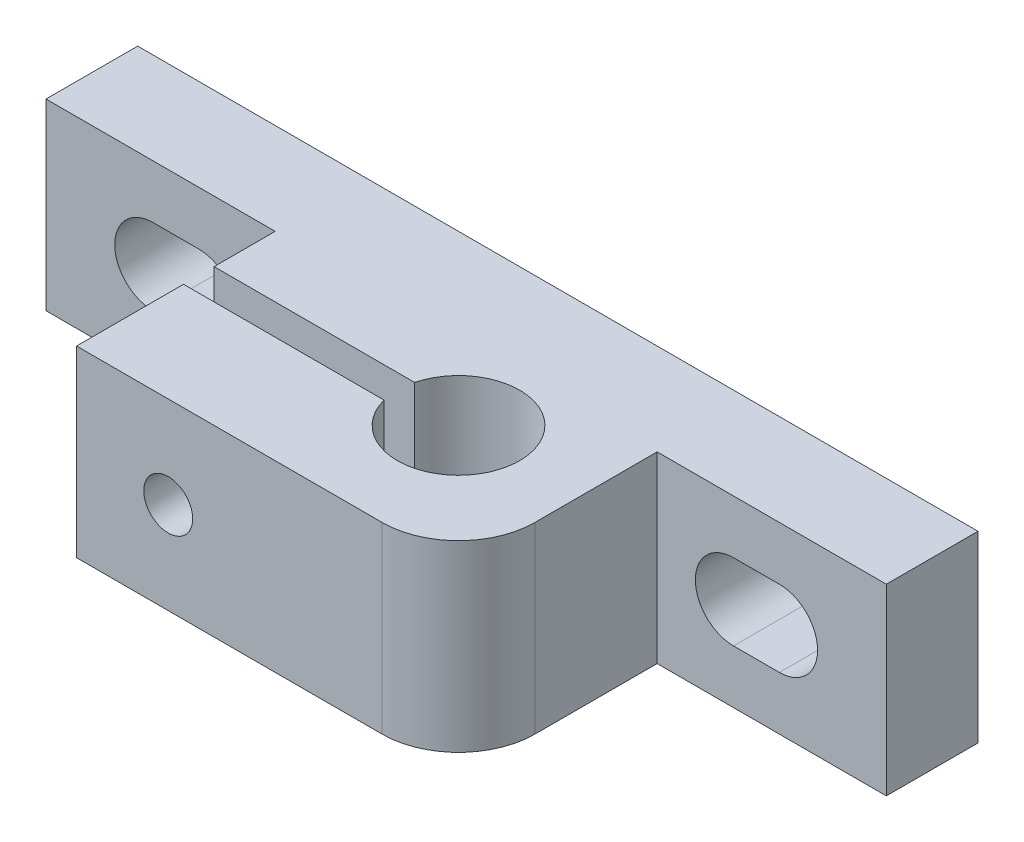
ISO-10303-21;
HEADER;
FILE_DESCRIPTION(('STEP AP214'),'2;1');
FILE_NAME('part.step','',(''),(''),'','','');
FILE_SCHEMA(('AUTOMOTIVE_DESIGN { 1 0 10303 214 1 1 1 1 }'));
ENDSEC;
DATA;
#1=APPLICATION_CONTEXT('core data for automotive mechanical design processes');
#2=APPLICATION_PROTOCOL_DEFINITION('international standard','automotive_design',2000,#1);
#3=PRODUCT_CONTEXT('',#1,'mechanical');
#4=PRODUCT('Part','Part','',(#3));
#5=PRODUCT_RELATED_PRODUCT_CATEGORY('part','',(#4));
#6=PRODUCT_DEFINITION_FORMATION('','',#4);
#7=PRODUCT_DEFINITION_CONTEXT('part definition',#1,'design');
#8=PRODUCT_DEFINITION('design','',#6,#7);
#9=PRODUCT_DEFINITION_SHAPE('','',#8);
#10=(LENGTH_UNIT() NAMED_UNIT(*) SI_UNIT(.MILLI.,.METRE.));
#11=(NAMED_UNIT(*) PLANE_ANGLE_UNIT() SI_UNIT($,.RADIAN.));
#12=(NAMED_UNIT(*) SI_UNIT($,.STERADIAN.) SOLID_ANGLE_UNIT());
#13=UNCERTAINTY_MEASURE_WITH_UNIT(LENGTH_MEASURE(1.E-05),#10,'distance_accuracy_value','');
#14=(GEOMETRIC_REPRESENTATION_CONTEXT(3) GLOBAL_UNCERTAINTY_ASSIGNED_CONTEXT((#13)) GLOBAL_UNIT_ASSIGNED_CONTEXT((#10,
#11,#12)) REPRESENTATION_CONTEXT('',''));
#15=CARTESIAN_POINT('',(0.,0.,0.));
#16=DIRECTION('',(0.,0.,1.));
#17=DIRECTION('',(1.,0.,0.));
#18=AXIS2_PLACEMENT_3D('',#15,#16,#17);
#19=CARTESIAN_POINT('',(21.,6.,-1.));
#20=DIRECTION('',(0.,0.,1.));
#21=DIRECTION('',(1.,0.,0.));
#22=AXIS2_PLACEMENT_3D('',#19,#20,#21);
#23=CYLINDRICAL_SURFACE('',#22,1.6);
#24=CARTESIAN_POINT('',(21.,6.,10.));
#25=DIRECTION('',(0.,0.,-1.));
#26=DIRECTION('',(-1.,0.,0.));
#27=AXIS2_PLACEMENT_3D('',#24,#25,#26);
#28=CIRCLE('',#27,1.6);
#29=CARTESIAN_POINT('',(19.4,6.,10.));
#30=VERTEX_POINT('',#29);
#31=EDGE_CURVE('E298',#30,#30,#28,.T.);
#32=ORIENTED_EDGE('',*,*,#31,.F.);
#33=EDGE_LOOP('',(#32));
#34=FACE_BOUND('',#33,.T.);
#35=CARTESIAN_POINT('',(21.,6.,8.));
#36=DIRECTION('',(0.,0.,-1.));
#37=DIRECTION('',(-1.,0.,0.));
#38=AXIS2_PLACEMENT_3D('',#35,#36,#37);
#39=CIRCLE('',#38,1.6);
#40=CARTESIAN_POINT('',(19.4,6.,8.));
#41=VERTEX_POINT('',#40);
#42=EDGE_CURVE('E37',#41,#41,#39,.F.);
#43=ORIENTED_EDGE('',*,*,#42,.F.);
#44=EDGE_LOOP('',(#43));
#45=FACE_BOUND('',#44,.T.);
#46=ADVANCED_FACE('F33',(#34,#45),#23,.F.);
#47=CARTESIAN_POINT('',(15.,0.,19.));
#48=DIRECTION('',(1.,0.,0.));
#49=DIRECTION('',(0.,0.,-1.));
#50=AXIS2_PLACEMENT_3D('',#47,#48,#49);
#51=PLANE('',#50);
#52=DIRECTION('',(0.,0.,-1.));
#53=VECTOR('',#52,1.);
#54=CARTESIAN_POINT('',(15.,0.,19.));
#55=LINE('',#54,#53);
#56=CARTESIAN_POINT('',(15.,0.,10.));
#57=VERTEX_POINT('',#56);
#58=CARTESIAN_POINT('',(15.,0.,6.));
#59=VERTEX_POINT('',#58);
#60=EDGE_CURVE('E382',#57,#59,#55,.T.);
#61=ORIENTED_EDGE('',*,*,#60,.F.);
#62=DIRECTION('',(0.,1.,0.));
#63=VECTOR('',#62,1.);
#64=CARTESIAN_POINT('',(15.,0.,10.));
#65=LINE('',#64,#63);
#66=CARTESIAN_POINT('',(15.,12.,10.));
#67=VERTEX_POINT('',#66);
#68=EDGE_CURVE('E42',#57,#67,#65,.T.);
#69=ORIENTED_EDGE('',*,*,#68,.T.);
#70=DIRECTION('',(0.,0.,-1.));
#71=VECTOR('',#70,1.);
#72=CARTESIAN_POINT('',(15.,12.,19.));
#73=LINE('',#72,#71);
#74=CARTESIAN_POINT('',(15.,12.,6.));
#75=VERTEX_POINT('',#74);
#76=EDGE_CURVE('E359',#67,#75,#73,.T.);
#77=ORIENTED_EDGE('',*,*,#76,.T.);
#78=DIRECTION('',(0.,-1.,0.));
#79=VECTOR('',#78,1.);
#80=CARTESIAN_POINT('',(15.,0.,6.));
#81=LINE('',#80,#79);
#82=EDGE_CURVE('E349',#75,#59,#81,.T.);
#83=ORIENTED_EDGE('',*,*,#82,.T.);
#84=EDGE_LOOP('',(#61,#69,#77,#83));
#85=FACE_BOUND('',#84,.T.);
#86=ADVANCED_FACE('F392',(#85),#51,.F.);
#87=CARTESIAN_POINT('',(0.,0.,6.));
#88=DIRECTION('',(0.,0.,-1.));
#89=DIRECTION('',(-1.,0.,0.));
#90=AXIS2_PLACEMENT_3D('',#87,#88,#89);
#91=PLANE('',#90);
#92=CARTESIAN_POINT('',(7.,6.,6.));
#93=DIRECTION('',(0.,0.,1.));
#94=DIRECTION('',(1.,0.,0.));
#95=AXIS2_PLACEMENT_3D('',#92,#93,#94);
#96=CIRCLE('',#95,2.5);
#97=CARTESIAN_POINT('',(7.,8.5,6.));
#98=VERTEX_POINT('',#97);
#99=CARTESIAN_POINT('',(7.,3.5,6.));
#100=VERTEX_POINT('',#99);
#101=EDGE_CURVE('E461',#98,#100,#96,.T.);
#102=ORIENTED_EDGE('',*,*,#101,.F.);
#103=DIRECTION('',(-1.,0.,0.));
#104=VECTOR('',#103,1.);
#105=CARTESIAN_POINT('',(7.,8.5,6.));
#106=LINE('',#105,#104);
#107=CARTESIAN_POINT('',(10.,8.5,6.));
#108=VERTEX_POINT('',#107);
#109=EDGE_CURVE('E457',#108,#98,#106,.T.);
#110=ORIENTED_EDGE('',*,*,#109,.F.);
#111=CARTESIAN_POINT('',(10.,6.,6.));
#112=DIRECTION('',(0.,0.,1.));
#113=DIRECTION('',(1.,0.,0.));
#114=AXIS2_PLACEMENT_3D('',#111,#112,#113);
#115=CIRCLE('',#114,2.5);
#116=CARTESIAN_POINT('',(9.99999999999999,3.5,6.));
#117=VERTEX_POINT('',#116);
#118=EDGE_CURVE('E473',#117,#108,#115,.T.);
#119=ORIENTED_EDGE('',*,*,#118,.F.);
#120=DIRECTION('',(1.,0.,0.));
#121=VECTOR('',#120,1.);
#122=CARTESIAN_POINT('',(7.,3.5,6.));
#123=LINE('',#122,#121);
#124=EDGE_CURVE('E476',#100,#117,#123,.T.);
#125=ORIENTED_EDGE('',*,*,#124,.F.);
#126=EDGE_LOOP('',(#102,#110,#119,#125));
#127=FACE_BOUND('',#126,.T.);
#128=ORIENTED_EDGE('',*,*,#82,.F.);
#129=DIRECTION('',(-1.,0.,0.));
#130=VECTOR('',#129,1.);
#131=CARTESIAN_POINT('',(0.,12.,6.));
#132=LINE('',#131,#130);
#133=CARTESIAN_POINT('',(0.,12.,6.));
#134=VERTEX_POINT('',#133);
#135=EDGE_CURVE('E400',#75,#134,#132,.T.);
#136=ORIENTED_EDGE('',*,*,#135,.T.);
#137=DIRECTION('',(0.,-1.,0.));
#138=VECTOR('',#137,1.);
#139=CARTESIAN_POINT('',(0.,0.,6.));
#140=LINE('',#139,#138);
#141=CARTESIAN_POINT('',(0.,0.,6.));
#142=VERTEX_POINT('',#141);
#143=EDGE_CURVE('E431',#134,#142,#140,.T.);
#144=ORIENTED_EDGE('',*,*,#143,.T.);
#145=DIRECTION('',(1.,0.,0.));
#146=VECTOR('',#145,1.);
#147=CARTESIAN_POINT('',(0.,0.,6.));
#148=LINE('',#147,#146);
#149=EDGE_CURVE('E411',#142,#59,#148,.T.);
#150=ORIENTED_EDGE('',*,*,#149,.T.);
#151=EDGE_LOOP('',(#128,#136,#144,#150));
#152=FACE_BOUND('',#151,.T.);
#153=ADVANCED_FACE('F548',(#127,#152),#91,.F.);
#154=CARTESIAN_POINT('',(48.,6.,6.));
#155=DIRECTION('',(0.,0.,1.));
#156=DIRECTION('',(-1.,0.,0.));
#157=AXIS2_PLACEMENT_3D('',#154,#155,#156);
#158=CIRCLE('',#157,2.5);
#159=CARTESIAN_POINT('',(48.,3.5,6.));
#160=VERTEX_POINT('',#159);
#161=CARTESIAN_POINT('',(48.,8.5,6.));
#162=VERTEX_POINT('',#161);
#163=EDGE_CURVE('E492',#160,#162,#158,.T.);
#164=ORIENTED_EDGE('',*,*,#163,.F.);
#165=DIRECTION('',(1.,0.,0.));
#166=VECTOR('',#165,1.);
#167=CARTESIAN_POINT('',(48.,3.5,6.));
#168=LINE('',#167,#166);
#169=CARTESIAN_POINT('',(45.,3.5,6.));
#170=VERTEX_POINT('',#169);
#171=EDGE_CURVE('E488',#170,#160,#168,.T.);
#172=ORIENTED_EDGE('',*,*,#171,.F.);
#173=CARTESIAN_POINT('',(45.,6.,6.));
#174=DIRECTION('',(0.,0.,1.));
#175=DIRECTION('',(-1.,0.,0.));
#176=AXIS2_PLACEMENT_3D('',#173,#174,#175);
#177=CIRCLE('',#176,2.5);
#178=CARTESIAN_POINT('',(45.,8.5,6.));
#179=VERTEX_POINT('',#178);
#180=EDGE_CURVE('E504',#179,#170,#177,.T.);
#181=ORIENTED_EDGE('',*,*,#180,.F.);
#182=DIRECTION('',(-1.,0.,0.));
#183=VECTOR('',#182,1.);
#184=CARTESIAN_POINT('',(48.,8.5,6.));
#185=LINE('',#184,#183);
#186=EDGE_CURVE('E507',#162,#179,#185,.T.);
#187=ORIENTED_EDGE('',*,*,#186,.F.);
#188=EDGE_LOOP('',(#164,#172,#181,#187));
#189=FACE_BOUND('',#188,.T.);
#190=DIRECTION('',(0.,1.,0.));
#191=VECTOR('',#190,1.);
#192=CARTESIAN_POINT('',(40.,0.,6.));
#193=LINE('',#192,#191);
#194=CARTESIAN_POINT('',(40.,0.,6.));
#195=VERTEX_POINT('',#194);
#196=CARTESIAN_POINT('',(40.,12.,6.));
#197=VERTEX_POINT('',#196);
#198=EDGE_CURVE('E354',#195,#197,#193,.T.);
#199=ORIENTED_EDGE('',*,*,#198,.F.);
#200=CARTESIAN_POINT('',(55.,0.,6.));
#201=VERTEX_POINT('',#200);
#202=EDGE_CURVE('E443',#195,#201,#148,.T.);
#203=ORIENTED_EDGE('',*,*,#202,.T.);
#204=DIRECTION('',(0.,1.,0.));
#205=VECTOR('',#204,1.);
#206=CARTESIAN_POINT('',(55.,0.,6.));
#207=LINE('',#206,#205);
#208=CARTESIAN_POINT('',(55.,12.,6.));
#209=VERTEX_POINT('',#208);
#210=EDGE_CURVE('E407',#201,#209,#207,.T.);
#211=ORIENTED_EDGE('',*,*,#210,.T.);
#212=EDGE_CURVE('E406',#209,#197,#132,.T.);
#213=ORIENTED_EDGE('',*,*,#212,.T.);
#214=EDGE_LOOP('',(#199,#203,#211,#213));
#215=FACE_BOUND('',#214,.T.);
#216=ADVANCED_FACE('F520',(#189,#215),#91,.F.);
#217=CARTESIAN_POINT('',(0.,0.,0.));
#218=DIRECTION('',(0.,0.,-1.));
#219=DIRECTION('',(-1.,0.,0.));
#220=AXIS2_PLACEMENT_3D('',#217,#218,#219);
#221=PLANE('',#220);
#222=DIRECTION('',(0.,-1.,0.));
#223=VECTOR('',#222,1.);
#224=CARTESIAN_POINT('',(37.6724189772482,9.5,0.));
#225=LINE('',#224,#223);
#226=CARTESIAN_POINT('',(37.6724189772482,9.5,0.));
#227=VERTEX_POINT('',#226);
#228=CARTESIAN_POINT('',(37.6724189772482,2.5,0.));
#229=VERTEX_POINT('',#228);
#230=EDGE_CURVE('E57',#227,#229,#225,.T.);
#231=ORIENTED_EDGE('',*,*,#230,.F.);
#232=DIRECTION('',(1.,0.,0.));
#233=VECTOR('',#232,1.);
#234=CARTESIAN_POINT('',(37.6724189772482,9.5,0.));
#235=LINE('',#234,#233);
#236=CARTESIAN_POINT('',(17.15852847,9.5,0.));
#237=VERTEX_POINT('',#236);
#238=EDGE_CURVE('E305',#237,#227,#235,.T.);
#239=ORIENTED_EDGE('',*,*,#238,.F.);
#240=DIRECTION('',(0.,1.,0.));
#241=VECTOR('',#240,1.);
#242=CARTESIAN_POINT('',(17.15852847,9.5,0.));
#243=LINE('',#242,#241);
#244=CARTESIAN_POINT('',(17.15852847,2.5,0.));
#245=VERTEX_POINT('',#244);
#246=EDGE_CURVE('E319',#245,#237,#243,.T.);
#247=ORIENTED_EDGE('',*,*,#246,.F.);
#248=DIRECTION('',(-1.,0.,0.));
#249=VECTOR('',#248,1.);
#250=CARTESIAN_POINT('',(37.6724189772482,2.5,0.));
#251=LINE('',#250,#249);
#252=EDGE_CURVE('E316',#229,#245,#251,.T.);
#253=ORIENTED_EDGE('',*,*,#252,.F.);
#254=EDGE_LOOP('',(#231,#239,#247,#253));
#255=FACE_BOUND('',#254,.T.);
#256=DIRECTION('',(-1.,0.,0.));
#257=VECTOR('',#256,1.);
#258=CARTESIAN_POINT('',(7.,8.5,0.));
#259=LINE('',#258,#257);
#260=CARTESIAN_POINT('',(10.,8.5,0.));
#261=VERTEX_POINT('',#260);
#262=CARTESIAN_POINT('',(7.,8.5,0.));
#263=VERTEX_POINT('',#262);
#264=EDGE_CURVE('E458',#261,#263,#259,.T.);
#265=ORIENTED_EDGE('',*,*,#264,.T.);
#266=CARTESIAN_POINT('',(7.,6.,0.));
#267=DIRECTION('',(0.,0.,1.));
#268=DIRECTION('',(1.,0.,0.));
#269=AXIS2_PLACEMENT_3D('',#266,#267,#268);
#270=CIRCLE('',#269,2.5);
#271=CARTESIAN_POINT('',(7.,3.5,0.));
#272=VERTEX_POINT('',#271);
#273=EDGE_CURVE('E468',#263,#272,#270,.T.);
#274=ORIENTED_EDGE('',*,*,#273,.T.);
#275=DIRECTION('',(1.,0.,0.));
#276=VECTOR('',#275,1.);
#277=CARTESIAN_POINT('',(7.,3.5,0.));
#278=LINE('',#277,#276);
#279=CARTESIAN_POINT('',(9.99999999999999,3.5,0.));
#280=VERTEX_POINT('',#279);
#281=EDGE_CURVE('E465',#272,#280,#278,.T.);
#282=ORIENTED_EDGE('',*,*,#281,.T.);
#283=CARTESIAN_POINT('',(10.,6.,0.));
#284=DIRECTION('',(0.,0.,1.));
#285=DIRECTION('',(1.,0.,0.));
#286=AXIS2_PLACEMENT_3D('',#283,#284,#285);
#287=CIRCLE('',#286,2.5);
#288=EDGE_CURVE('E462',#280,#261,#287,.T.);
#289=ORIENTED_EDGE('',*,*,#288,.T.);
#290=EDGE_LOOP('',(#265,#274,#282,#289));
#291=FACE_BOUND('',#290,.T.);
#292=DIRECTION('',(0.,-1.,0.));
#293=VECTOR('',#292,1.);
#294=CARTESIAN_POINT('',(0.,0.,0.));
#295=LINE('',#294,#293);
#296=CARTESIAN_POINT('',(0.,12.,0.));
#297=VERTEX_POINT('',#296);
#298=CARTESIAN_POINT('',(0.,0.,0.));
#299=VERTEX_POINT('',#298);
#300=EDGE_CURVE('E420',#297,#299,#295,.T.);
#301=ORIENTED_EDGE('',*,*,#300,.F.);
#302=DIRECTION('',(-1.,0.,0.));
#303=VECTOR('',#302,1.);
#304=CARTESIAN_POINT('',(0.,12.,0.));
#305=LINE('',#304,#303);
#306=CARTESIAN_POINT('',(55.,12.,0.));
#307=VERTEX_POINT('',#306);
#308=EDGE_CURVE('E429',#307,#297,#305,.T.);
#309=ORIENTED_EDGE('',*,*,#308,.F.);
#310=DIRECTION('',(0.,1.,0.));
#311=VECTOR('',#310,1.);
#312=CARTESIAN_POINT('',(55.,0.,0.));
#313=LINE('',#312,#311);
#314=CARTESIAN_POINT('',(55.,0.,0.));
#315=VERTEX_POINT('',#314);
#316=EDGE_CURVE('E427',#315,#307,#313,.T.);
#317=ORIENTED_EDGE('',*,*,#316,.F.);
#318=DIRECTION('',(1.,0.,0.));
#319=VECTOR('',#318,1.);
#320=CARTESIAN_POINT('',(0.,0.,0.));
#321=LINE('',#320,#319);
#322=EDGE_CURVE('E424',#299,#315,#321,.T.);
#323=ORIENTED_EDGE('',*,*,#322,.F.);
#324=EDGE_LOOP('',(#301,#309,#317,#323));
#325=FACE_BOUND('',#324,.T.);
#326=DIRECTION('',(1.,0.,0.));
#327=VECTOR('',#326,1.);
#328=CARTESIAN_POINT('',(48.,3.5,0.));
#329=LINE('',#328,#327);
#330=CARTESIAN_POINT('',(45.,3.5,0.));
#331=VERTEX_POINT('',#330);
#332=CARTESIAN_POINT('',(48.,3.5,0.));
#333=VERTEX_POINT('',#332);
#334=EDGE_CURVE('E489',#331,#333,#329,.T.);
#335=ORIENTED_EDGE('',*,*,#334,.T.);
#336=CARTESIAN_POINT('',(48.,6.,0.));
#337=DIRECTION('',(0.,0.,1.));
#338=DIRECTION('',(-1.,0.,0.));
#339=AXIS2_PLACEMENT_3D('',#336,#337,#338);
#340=CIRCLE('',#339,2.5);
#341=CARTESIAN_POINT('',(48.,8.5,0.));
#342=VERTEX_POINT('',#341);
#343=EDGE_CURVE('E499',#333,#342,#340,.T.);
#344=ORIENTED_EDGE('',*,*,#343,.T.);
#345=DIRECTION('',(-1.,0.,0.));
#346=VECTOR('',#345,1.);
#347=CARTESIAN_POINT('',(48.,8.5,0.));
#348=LINE('',#347,#346);
#349=CARTESIAN_POINT('',(45.,8.5,0.));
#350=VERTEX_POINT('',#349);
#351=EDGE_CURVE('E496',#342,#350,#348,.T.);
#352=ORIENTED_EDGE('',*,*,#351,.T.);
#353=CARTESIAN_POINT('',(45.,6.,0.));
#354=DIRECTION('',(0.,0.,1.));
#355=DIRECTION('',(-1.,0.,0.));
#356=AXIS2_PLACEMENT_3D('',#353,#354,#355);
#357=CIRCLE('',#356,2.5);
#358=EDGE_CURVE('E493',#350,#331,#357,.T.);
#359=ORIENTED_EDGE('',*,*,#358,.T.);
#360=EDGE_LOOP('',(#335,#344,#352,#359));
#361=FACE_BOUND('',#360,.T.);
#362=ADVANCED_FACE('F527',(#255,#291,#325,#361),#221,.T.);
#363=CARTESIAN_POINT('',(0.,0.,6.));
#364=DIRECTION('',(1.,0.,0.));
#365=DIRECTION('',(0.,0.,-1.));
#366=AXIS2_PLACEMENT_3D('',#363,#364,#365);
#367=PLANE('',#366);
#368=ORIENTED_EDGE('',*,*,#300,.T.);
#369=DIRECTION('',(0.,0.,-1.));
#370=VECTOR('',#369,1.);
#371=CARTESIAN_POINT('',(0.,0.,6.));
#372=LINE('',#371,#370);
#373=EDGE_CURVE('E439',#142,#299,#372,.T.);
#374=ORIENTED_EDGE('',*,*,#373,.F.);
#375=ORIENTED_EDGE('',*,*,#143,.F.);
#376=DIRECTION('',(0.,0.,-1.));
#377=VECTOR('',#376,1.);
#378=CARTESIAN_POINT('',(0.,12.,6.));
#379=LINE('',#378,#377);
#380=EDGE_CURVE('E402',#134,#297,#379,.T.);
#381=ORIENTED_EDGE('',*,*,#380,.T.);
#382=EDGE_LOOP('',(#368,#374,#375,#381));
#383=FACE_BOUND('',#382,.T.);
#384=ADVANCED_FACE('F620',(#383),#367,.F.);
#385=CARTESIAN_POINT('',(0.,0.,6.));
#386=DIRECTION('',(0.,1.,0.));
#387=DIRECTION('',(0.,0.,1.));
#388=AXIS2_PLACEMENT_3D('',#385,#386,#387);
#389=PLANE('',#388);
#390=CARTESIAN_POINT('',(32.,0.,11.));
#391=DIRECTION('',(0.,-1.,0.));
#392=DIRECTION('',(0.,0.,-1.));
#393=AXIS2_PLACEMENT_3D('',#390,#391,#392);
#394=CIRCLE('',#393,4.);
#395=CARTESIAN_POINT('',(28.1270166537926,0.,10.));
#396=VERTEX_POINT('',#395);
#397=CARTESIAN_POINT('',(28.1270166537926,0.,12.));
#398=VERTEX_POINT('',#397);
#399=EDGE_CURVE('E334',#396,#398,#394,.T.);
#400=ORIENTED_EDGE('',*,*,#399,.F.);
#401=DIRECTION('',(1.,0.,0.));
#402=VECTOR('',#401,1.);
#403=CARTESIAN_POINT('',(0.,0.,10.));
#404=LINE('',#403,#402);
#405=EDGE_CURVE('E326',#57,#396,#404,.T.);
#406=ORIENTED_EDGE('',*,*,#405,.F.);
#407=ORIENTED_EDGE('',*,*,#60,.T.);
#408=ORIENTED_EDGE('',*,*,#149,.F.);
#409=ORIENTED_EDGE('',*,*,#373,.T.);
#410=ORIENTED_EDGE('',*,*,#322,.T.);
#411=DIRECTION('',(0.,0.,-1.));
#412=VECTOR('',#411,1.);
#413=CARTESIAN_POINT('',(55.,0.,6.));
#414=LINE('',#413,#412);
#415=EDGE_CURVE('E436',#201,#315,#414,.T.);
#416=ORIENTED_EDGE('',*,*,#415,.F.);
#417=ORIENTED_EDGE('',*,*,#202,.F.);
#418=DIRECTION('',(0.,0.,-1.));
#419=VECTOR('',#418,1.);
#420=CARTESIAN_POINT('',(40.,0.,19.));
#421=LINE('',#420,#419);
#422=CARTESIAN_POINT('',(40.,0.,14.));
#423=VERTEX_POINT('',#422);
#424=EDGE_CURVE('E584',#423,#195,#421,.T.);
#425=ORIENTED_EDGE('',*,*,#424,.F.);
#426=CARTESIAN_POINT('',(35.,0.,14.));
#427=DIRECTION('',(0.,1.,0.));
#428=DIRECTION('',(0.,0.,1.));
#429=AXIS2_PLACEMENT_3D('',#426,#427,#428);
#430=CIRCLE('',#429,5.);
#431=CARTESIAN_POINT('',(35.,0.,19.));
#432=VERTEX_POINT('',#431);
#433=EDGE_CURVE('E387',#423,#432,#430,.F.);
#434=ORIENTED_EDGE('',*,*,#433,.T.);
#435=DIRECTION('',(1.,0.,0.));
#436=VECTOR('',#435,1.);
#437=CARTESIAN_POINT('',(15.,0.,19.));
#438=LINE('',#437,#436);
#439=CARTESIAN_POINT('',(15.,0.,19.));
#440=VERTEX_POINT('',#439);
#441=EDGE_CURVE('E353',#440,#432,#438,.T.);
#442=ORIENTED_EDGE('',*,*,#441,.F.);
#443=CARTESIAN_POINT('',(15.,0.,12.));
#444=VERTEX_POINT('',#443);
#445=EDGE_CURVE('E502',#440,#444,#55,.T.);
#446=ORIENTED_EDGE('',*,*,#445,.T.);
#447=DIRECTION('',(-1.,0.,0.));
#448=VECTOR('',#447,1.);
#449=CARTESIAN_POINT('',(0.,0.,12.));
#450=LINE('',#449,#448);
#451=EDGE_CURVE('E337',#398,#444,#450,.T.);
#452=ORIENTED_EDGE('',*,*,#451,.F.);
#453=EDGE_LOOP('',(#400,#406,#407,#408,#409,#410,#416,#417,#425,#434,#442,#446,#452));
#454=FACE_BOUND('',#453,.T.);
#455=ADVANCED_FACE('F581',(#454),#389,.F.);
#456=CARTESIAN_POINT('',(55.,0.,6.));
#457=DIRECTION('',(-1.,0.,0.));
#458=DIRECTION('',(0.,0.,1.));
#459=AXIS2_PLACEMENT_3D('',#456,#457,#458);
#460=PLANE('',#459);
#461=ORIENTED_EDGE('',*,*,#316,.T.);
#462=DIRECTION('',(0.,0.,-1.));
#463=VECTOR('',#462,1.);
#464=CARTESIAN_POINT('',(55.,12.,6.));
#465=LINE('',#464,#463);
#466=EDGE_CURVE('E433',#209,#307,#465,.T.);
#467=ORIENTED_EDGE('',*,*,#466,.F.);
#468=ORIENTED_EDGE('',*,*,#210,.F.);
#469=ORIENTED_EDGE('',*,*,#415,.T.);
#470=EDGE_LOOP('',(#461,#467,#468,#469));
#471=FACE_BOUND('',#470,.T.);
#472=ADVANCED_FACE('F614',(#471),#460,.F.);
#473=CARTESIAN_POINT('',(0.,12.,6.));
#474=DIRECTION('',(0.,-1.,0.));
#475=DIRECTION('',(0.,0.,-1.));
#476=AXIS2_PLACEMENT_3D('',#473,#474,#475);
#477=PLANE('',#476);
#478=ORIENTED_EDGE('',*,*,#76,.F.);
#479=DIRECTION('',(1.,0.,0.));
#480=VECTOR('',#479,1.);
#481=CARTESIAN_POINT('',(0.,12.,10.));
#482=LINE('',#481,#480);
#483=CARTESIAN_POINT('',(28.1270166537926,12.,10.));
#484=VERTEX_POINT('',#483);
#485=EDGE_CURVE('E346',#67,#484,#482,.T.);
#486=ORIENTED_EDGE('',*,*,#485,.T.);
#487=CARTESIAN_POINT('',(32.,12.,11.));
#488=DIRECTION('',(0.,-1.,0.));
#489=DIRECTION('',(0.,0.,-1.));
#490=AXIS2_PLACEMENT_3D('',#487,#488,#489);
#491=CIRCLE('',#490,4.);
#492=CARTESIAN_POINT('',(28.1270166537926,12.,12.));
#493=VERTEX_POINT('',#492);
#494=EDGE_CURVE('E11',#484,#493,#491,.T.);
#495=ORIENTED_EDGE('',*,*,#494,.T.);
#496=DIRECTION('',(-1.,0.,0.));
#497=VECTOR('',#496,1.);
#498=CARTESIAN_POINT('',(0.,12.,12.));
#499=LINE('',#498,#497);
#500=CARTESIAN_POINT('',(15.,12.,12.));
#501=VERTEX_POINT('',#500);
#502=EDGE_CURVE('E342',#493,#501,#499,.T.);
#503=ORIENTED_EDGE('',*,*,#502,.T.);
#504=CARTESIAN_POINT('',(15.,12.,19.));
#505=VERTEX_POINT('',#504);
#506=EDGE_CURVE('E370',#505,#501,#73,.T.);
#507=ORIENTED_EDGE('',*,*,#506,.F.);
#508=DIRECTION('',(-1.,0.,0.));
#509=VECTOR('',#508,1.);
#510=CARTESIAN_POINT('',(15.,12.,19.));
#511=LINE('',#510,#509);
#512=CARTESIAN_POINT('',(35.,12.,19.));
#513=VERTEX_POINT('',#512);
#514=EDGE_CURVE('E357',#513,#505,#511,.T.);
#515=ORIENTED_EDGE('',*,*,#514,.F.);
#516=CARTESIAN_POINT('',(35.,12.,14.));
#517=DIRECTION('',(0.,-1.,0.));
#518=DIRECTION('',(0.,0.,-1.));
#519=AXIS2_PLACEMENT_3D('',#516,#517,#518);
#520=CIRCLE('',#519,5.);
#521=CARTESIAN_POINT('',(40.,12.,14.));
#522=VERTEX_POINT('',#521);
#523=EDGE_CURVE('E591',#513,#522,#520,.F.);
#524=ORIENTED_EDGE('',*,*,#523,.T.);
#525=DIRECTION('',(0.,0.,-1.));
#526=VECTOR('',#525,1.);
#527=CARTESIAN_POINT('',(40.,12.,19.));
#528=LINE('',#527,#526);
#529=EDGE_CURVE('E373',#522,#197,#528,.T.);
#530=ORIENTED_EDGE('',*,*,#529,.T.);
#531=ORIENTED_EDGE('',*,*,#212,.F.);
#532=ORIENTED_EDGE('',*,*,#466,.T.);
#533=ORIENTED_EDGE('',*,*,#308,.T.);
#534=ORIENTED_EDGE('',*,*,#380,.F.);
#535=ORIENTED_EDGE('',*,*,#135,.F.);
#536=EDGE_LOOP('',(#478,#486,#495,#503,#507,#515,#524,#530,#531,#532,#533,#534,#535));
#537=FACE_BOUND('',#536,.T.);
#538=ADVANCED_FACE('F398',(#537),#477,.F.);
#539=CARTESIAN_POINT('',(7.,6.,6.));
#540=DIRECTION('',(0.,0.,-1.));
#541=DIRECTION('',(-1.,0.,0.));
#542=AXIS2_PLACEMENT_3D('',#539,#540,#541);
#543=CYLINDRICAL_SURFACE('',#542,2.5);
#544=ORIENTED_EDGE('',*,*,#273,.F.);
#545=DIRECTION('',(0.,0.,-1.));
#546=VECTOR('',#545,1.);
#547=CARTESIAN_POINT('',(7.,8.5,6.));
#548=LINE('',#547,#546);
#549=EDGE_CURVE('E454',#98,#263,#548,.T.);
#550=ORIENTED_EDGE('',*,*,#549,.F.);
#551=ORIENTED_EDGE('',*,*,#101,.T.);
#552=DIRECTION('',(0.,0.,-1.));
#553=VECTOR('',#552,1.);
#554=CARTESIAN_POINT('',(7.,3.5,6.));
#555=LINE('',#554,#553);
#556=EDGE_CURVE('E425',#100,#272,#555,.T.);
#557=ORIENTED_EDGE('',*,*,#556,.T.);
#558=EDGE_LOOP('',(#544,#550,#551,#557));
#559=FACE_BOUND('',#558,.T.);
#560=ADVANCED_FACE('F804',(#559),#543,.F.);
#561=CARTESIAN_POINT('',(7.,3.5,6.));
#562=DIRECTION('',(0.,1.,0.));
#563=DIRECTION('',(-1.,0.,0.));
#564=AXIS2_PLACEMENT_3D('',#561,#562,#563);
#565=PLANE('',#564);
#566=ORIENTED_EDGE('',*,*,#281,.F.);
#567=ORIENTED_EDGE('',*,*,#556,.F.);
#568=ORIENTED_EDGE('',*,*,#124,.T.);
#569=DIRECTION('',(0.,0.,-1.));
#570=VECTOR('',#569,1.);
#571=CARTESIAN_POINT('',(9.99999999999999,3.5,6.));
#572=LINE('',#571,#570);
#573=EDGE_CURVE('E450',#117,#280,#572,.T.);
#574=ORIENTED_EDGE('',*,*,#573,.T.);
#575=EDGE_LOOP('',(#566,#567,#568,#574));
#576=FACE_BOUND('',#575,.T.);
#577=ADVANCED_FACE('F811',(#576),#565,.T.);
#578=CARTESIAN_POINT('',(10.,6.,6.));
#579=DIRECTION('',(0.,0.,-1.));
#580=DIRECTION('',(-1.,0.,0.));
#581=AXIS2_PLACEMENT_3D('',#578,#579,#580);
#582=CYLINDRICAL_SURFACE('',#581,2.5);
#583=ORIENTED_EDGE('',*,*,#288,.F.);
#584=ORIENTED_EDGE('',*,*,#573,.F.);
#585=ORIENTED_EDGE('',*,*,#118,.T.);
#586=DIRECTION('',(0.,0.,-1.));
#587=VECTOR('',#586,1.);
#588=CARTESIAN_POINT('',(10.,8.5,6.));
#589=LINE('',#588,#587);
#590=EDGE_CURVE('E452',#108,#261,#589,.T.);
#591=ORIENTED_EDGE('',*,*,#590,.T.);
#592=EDGE_LOOP('',(#583,#584,#585,#591));
#593=FACE_BOUND('',#592,.T.);
#594=ADVANCED_FACE('F813',(#593),#582,.F.);
#595=CARTESIAN_POINT('',(7.,8.5,6.));
#596=DIRECTION('',(0.,-1.,0.));
#597=DIRECTION('',(0.,0.,-1.));
#598=AXIS2_PLACEMENT_3D('',#595,#596,#597);
#599=PLANE('',#598);
#600=ORIENTED_EDGE('',*,*,#264,.F.);
#601=ORIENTED_EDGE('',*,*,#590,.F.);
#602=ORIENTED_EDGE('',*,*,#109,.T.);
#603=ORIENTED_EDGE('',*,*,#549,.T.);
#604=EDGE_LOOP('',(#600,#601,#602,#603));
#605=FACE_BOUND('',#604,.T.);
#606=ADVANCED_FACE('F799',(#605),#599,.T.);
#607=CARTESIAN_POINT('',(48.,6.,6.));
#608=DIRECTION('',(0.,0.,-1.));
#609=DIRECTION('',(-1.,0.,0.));
#610=AXIS2_PLACEMENT_3D('',#607,#608,#609);
#611=CYLINDRICAL_SURFACE('',#610,2.5);
#612=ORIENTED_EDGE('',*,*,#343,.F.);
#613=DIRECTION('',(0.,0.,-1.));
#614=VECTOR('',#613,1.);
#615=CARTESIAN_POINT('',(48.,3.5,6.));
#616=LINE('',#615,#614);
#617=EDGE_CURVE('E485',#160,#333,#616,.T.);
#618=ORIENTED_EDGE('',*,*,#617,.F.);
#619=ORIENTED_EDGE('',*,*,#163,.T.);
#620=DIRECTION('',(0.,0.,-1.));
#621=VECTOR('',#620,1.);
#622=CARTESIAN_POINT('',(48.,8.5,6.));
#623=LINE('',#622,#621);
#624=EDGE_CURVE('E471',#162,#342,#623,.T.);
#625=ORIENTED_EDGE('',*,*,#624,.T.);
#626=EDGE_LOOP('',(#612,#618,#619,#625));
#627=FACE_BOUND('',#626,.T.);
#628=ADVANCED_FACE('F512',(#627),#611,.F.);
#629=CARTESIAN_POINT('',(48.,8.5,6.));
#630=DIRECTION('',(0.,-1.,0.));
#631=DIRECTION('',(1.,0.,0.));
#632=AXIS2_PLACEMENT_3D('',#629,#630,#631);
#633=PLANE('',#632);
#634=ORIENTED_EDGE('',*,*,#351,.F.);
#635=ORIENTED_EDGE('',*,*,#624,.F.);
#636=ORIENTED_EDGE('',*,*,#186,.T.);
#637=DIRECTION('',(0.,0.,-1.));
#638=VECTOR('',#637,1.);
#639=CARTESIAN_POINT('',(45.,8.5,6.));
#640=LINE('',#639,#638);
#641=EDGE_CURVE('E481',#179,#350,#640,.T.);
#642=ORIENTED_EDGE('',*,*,#641,.T.);
#643=EDGE_LOOP('',(#634,#635,#636,#642));
#644=FACE_BOUND('',#643,.T.);
#645=ADVANCED_FACE('F517',(#644),#633,.T.);
#646=CARTESIAN_POINT('',(45.,6.,6.));
#647=DIRECTION('',(0.,0.,-1.));
#648=DIRECTION('',(-1.,0.,0.));
#649=AXIS2_PLACEMENT_3D('',#646,#647,#648);
#650=CYLINDRICAL_SURFACE('',#649,2.5);
#651=ORIENTED_EDGE('',*,*,#358,.F.);
#652=ORIENTED_EDGE('',*,*,#641,.F.);
#653=ORIENTED_EDGE('',*,*,#180,.T.);
#654=DIRECTION('',(0.,0.,-1.));
#655=VECTOR('',#654,1.);
#656=CARTESIAN_POINT('',(45.,3.5,6.));
#657=LINE('',#656,#655);
#658=EDGE_CURVE('E483',#170,#331,#657,.T.);
#659=ORIENTED_EDGE('',*,*,#658,.T.);
#660=EDGE_LOOP('',(#651,#652,#653,#659));
#661=FACE_BOUND('',#660,.T.);
#662=ADVANCED_FACE('F524',(#661),#650,.F.);
#663=CARTESIAN_POINT('',(48.,3.5,6.));
#664=DIRECTION('',(0.,1.,0.));
#665=DIRECTION('',(-1.,0.,0.));
#666=AXIS2_PLACEMENT_3D('',#663,#664,#665);
#667=PLANE('',#666);
#668=ORIENTED_EDGE('',*,*,#334,.F.);
#669=ORIENTED_EDGE('',*,*,#658,.F.);
#670=ORIENTED_EDGE('',*,*,#171,.T.);
#671=ORIENTED_EDGE('',*,*,#617,.T.);
#672=EDGE_LOOP('',(#668,#669,#670,#671));
#673=FACE_BOUND('',#672,.T.);
#674=ADVANCED_FACE('F529',(#673),#667,.T.);
#675=ORIENTED_EDGE('',*,*,#506,.T.);
#676=DIRECTION('',(0.,-1.,0.));
#677=VECTOR('',#676,1.);
#678=CARTESIAN_POINT('',(15.,0.,12.));
#679=LINE('',#678,#677);
#680=EDGE_CURVE('E384',#501,#444,#679,.T.);
#681=ORIENTED_EDGE('',*,*,#680,.T.);
#682=ORIENTED_EDGE('',*,*,#445,.F.);
#683=DIRECTION('',(0.,-1.,0.));
#684=VECTOR('',#683,1.);
#685=CARTESIAN_POINT('',(15.,0.,19.));
#686=LINE('',#685,#684);
#687=EDGE_CURVE('E350',#505,#440,#686,.T.);
#688=ORIENTED_EDGE('',*,*,#687,.F.);
#689=EDGE_LOOP('',(#675,#681,#682,#688));
#690=FACE_BOUND('',#689,.T.);
#691=ADVANCED_FACE('F531',(#690),#51,.F.);
#692=CARTESIAN_POINT('',(40.,0.,19.));
#693=DIRECTION('',(-1.,0.,0.));
#694=DIRECTION('',(0.,0.,1.));
#695=AXIS2_PLACEMENT_3D('',#692,#693,#694);
#696=PLANE('',#695);
#697=ORIENTED_EDGE('',*,*,#529,.F.);
#698=DIRECTION('',(0.,1.,0.));
#699=VECTOR('',#698,1.);
#700=CARTESIAN_POINT('',(40.,0.,14.));
#701=LINE('',#700,#699);
#702=EDGE_CURVE('E592',#522,#423,#701,.F.);
#703=ORIENTED_EDGE('',*,*,#702,.T.);
#704=ORIENTED_EDGE('',*,*,#424,.T.);
#705=ORIENTED_EDGE('',*,*,#198,.T.);
#706=EDGE_LOOP('',(#697,#703,#704,#705));
#707=FACE_BOUND('',#706,.T.);
#708=ADVANCED_FACE('F537',(#707),#696,.F.);
#709=CARTESIAN_POINT('',(0.,0.,19.));
#710=DIRECTION('',(0.,0.,-1.));
#711=DIRECTION('',(-1.,0.,0.));
#712=AXIS2_PLACEMENT_3D('',#709,#710,#711);
#713=PLANE('',#712);
#714=CARTESIAN_POINT('',(21.,6.,19.));
#715=DIRECTION('',(0.,0.,1.));
#716=DIRECTION('',(1.,0.,0.));
#717=AXIS2_PLACEMENT_3D('',#714,#715,#716);
#718=CIRCLE('',#717,1.6);
#719=CARTESIAN_POINT('',(22.6,6.,19.));
#720=VERTEX_POINT('',#719);
#721=EDGE_CURVE('E292',#720,#720,#718,.T.);
#722=ORIENTED_EDGE('',*,*,#721,.F.);
#723=EDGE_LOOP('',(#722));
#724=FACE_BOUND('',#723,.T.);
#725=ORIENTED_EDGE('',*,*,#441,.T.);
#726=DIRECTION('',(0.,1.,0.));
#727=VECTOR('',#726,1.);
#728=CARTESIAN_POINT('',(35.,0.,19.));
#729=LINE('',#728,#727);
#730=EDGE_CURVE('E376',#432,#513,#729,.T.);
#731=ORIENTED_EDGE('',*,*,#730,.T.);
#732=ORIENTED_EDGE('',*,*,#514,.T.);
#733=ORIENTED_EDGE('',*,*,#687,.T.);
#734=EDGE_LOOP('',(#725,#731,#732,#733));
#735=FACE_BOUND('',#734,.T.);
#736=ADVANCED_FACE('F601',(#724,#735),#713,.F.);
#737=CARTESIAN_POINT('',(35.,0.,14.));
#738=DIRECTION('',(0.,1.,0.));
#739=DIRECTION('',(0.,0.,1.));
#740=AXIS2_PLACEMENT_3D('',#737,#738,#739);
#741=CYLINDRICAL_SURFACE('',#740,5.);
#742=ORIENTED_EDGE('',*,*,#433,.F.);
#743=ORIENTED_EDGE('',*,*,#702,.F.);
#744=ORIENTED_EDGE('',*,*,#523,.F.);
#745=ORIENTED_EDGE('',*,*,#730,.F.);
#746=EDGE_LOOP('',(#742,#743,#744,#745));
#747=FACE_BOUND('',#746,.T.);
#748=ADVANCED_FACE('F35',(#747),#741,.T.);
#749=CARTESIAN_POINT('',(32.,30.,11.));
#750=DIRECTION('',(0.,-1.,0.));
#751=DIRECTION('',(0.,0.,-1.));
#752=AXIS2_PLACEMENT_3D('',#749,#750,#751);
#753=CYLINDRICAL_SURFACE('',#752,4.);
#754=DIRECTION('',(0.,-1.,0.));
#755=VECTOR('',#754,1.);
#756=CARTESIAN_POINT('',(28.1270166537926,30.,10.));
#757=LINE('',#756,#755);
#758=EDGE_CURVE('E339',#484,#396,#757,.T.);
#759=ORIENTED_EDGE('',*,*,#758,.T.);
#760=ORIENTED_EDGE('',*,*,#399,.T.);
#761=DIRECTION('',(0.,-1.,0.));
#762=VECTOR('',#761,1.);
#763=CARTESIAN_POINT('',(28.1270166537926,30.,12.));
#764=LINE('',#763,#762);
#765=EDGE_CURVE('E340',#493,#398,#764,.T.);
#766=ORIENTED_EDGE('',*,*,#765,.F.);
#767=ORIENTED_EDGE('',*,*,#494,.F.);
#768=EDGE_LOOP('',(#759,#760,#766,#767));
#769=FACE_BOUND('',#768,.T.);
#770=ADVANCED_FACE('F577',(#769),#753,.F.);
#771=CARTESIAN_POINT('',(0.,30.,10.));
#772=DIRECTION('',(0.,0.,-1.));
#773=DIRECTION('',(-1.,0.,0.));
#774=AXIS2_PLACEMENT_3D('',#771,#772,#773);
#775=PLANE('',#774);
#776=ORIENTED_EDGE('',*,*,#31,.T.);
#777=EDGE_LOOP('',(#776));
#778=FACE_BOUND('',#777,.T.);
#779=ORIENTED_EDGE('',*,*,#68,.F.);
#780=ORIENTED_EDGE('',*,*,#405,.T.);
#781=ORIENTED_EDGE('',*,*,#758,.F.);
#782=ORIENTED_EDGE('',*,*,#485,.F.);
#783=EDGE_LOOP('',(#779,#780,#781,#782));
#784=FACE_BOUND('',#783,.T.);
#785=ADVANCED_FACE('F571',(#778,#784),#775,.F.);
#786=CARTESIAN_POINT('',(0.,30.,12.));
#787=DIRECTION('',(0.,0.,1.));
#788=DIRECTION('',(1.,0.,0.));
#789=AXIS2_PLACEMENT_3D('',#786,#787,#788);
#790=PLANE('',#789);
#791=CARTESIAN_POINT('',(21.,6.,12.));
#792=DIRECTION('',(0.,0.,1.));
#793=DIRECTION('',(1.,0.,0.));
#794=AXIS2_PLACEMENT_3D('',#791,#792,#793);
#795=CIRCLE('',#794,1.6);
#796=CARTESIAN_POINT('',(22.6,6.,12.));
#797=VERTEX_POINT('',#796);
#798=EDGE_CURVE('E295',#797,#797,#795,.T.);
#799=ORIENTED_EDGE('',*,*,#798,.T.);
#800=EDGE_LOOP('',(#799));
#801=FACE_BOUND('',#800,.T.);
#802=ORIENTED_EDGE('',*,*,#765,.T.);
#803=ORIENTED_EDGE('',*,*,#451,.T.);
#804=ORIENTED_EDGE('',*,*,#680,.F.);
#805=ORIENTED_EDGE('',*,*,#502,.F.);
#806=EDGE_LOOP('',(#802,#803,#804,#805));
#807=FACE_BOUND('',#806,.T.);
#808=ADVANCED_FACE('F567',(#801,#807),#790,.F.);
#809=CARTESIAN_POINT('',(37.6724189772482,9.5,5.));
#810=DIRECTION('',(1.,0.,0.));
#811=DIRECTION('',(0.,0.,-1.));
#812=AXIS2_PLACEMENT_3D('',#809,#810,#811);
#813=PLANE('',#812);
#814=ORIENTED_EDGE('',*,*,#230,.T.);
#815=DIRECTION('',(0.,0.,-1.));
#816=VECTOR('',#815,1.);
#817=CARTESIAN_POINT('',(37.6724189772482,2.5,5.));
#818=LINE('',#817,#816);
#819=CARTESIAN_POINT('',(37.6724189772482,2.5,5.));
#820=VERTEX_POINT('',#819);
#821=EDGE_CURVE('E314',#820,#229,#818,.T.);
#822=ORIENTED_EDGE('',*,*,#821,.F.);
#823=DIRECTION('',(0.,-1.,0.));
#824=VECTOR('',#823,1.);
#825=CARTESIAN_POINT('',(37.6724189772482,9.5,5.));
#826=LINE('',#825,#824);
#827=CARTESIAN_POINT('',(37.6724189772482,9.5,5.));
#828=VERTEX_POINT('',#827);
#829=EDGE_CURVE('E301',#828,#820,#826,.T.);
#830=ORIENTED_EDGE('',*,*,#829,.F.);
#831=DIRECTION('',(0.,0.,-1.));
#832=VECTOR('',#831,1.);
#833=CARTESIAN_POINT('',(37.6724189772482,9.5,5.));
#834=LINE('',#833,#832);
#835=EDGE_CURVE('E324',#828,#227,#834,.T.);
#836=ORIENTED_EDGE('',*,*,#835,.T.);
#837=EDGE_LOOP('',(#814,#822,#830,#836));
#838=FACE_BOUND('',#837,.T.);
#839=ADVANCED_FACE('F570',(#838),#813,.F.);
#840=CARTESIAN_POINT('',(37.6724189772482,9.5,5.));
#841=DIRECTION('',(0.,1.,0.));
#842=DIRECTION('',(-1.,0.,0.));
#843=AXIS2_PLACEMENT_3D('',#840,#841,#842);
#844=PLANE('',#843);
#845=ORIENTED_EDGE('',*,*,#238,.T.);
#846=ORIENTED_EDGE('',*,*,#835,.F.);
#847=DIRECTION('',(1.,0.,0.));
#848=VECTOR('',#847,1.);
#849=CARTESIAN_POINT('',(37.6724189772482,9.5,5.));
#850=LINE('',#849,#848);
#851=CARTESIAN_POINT('',(17.15852847,9.5,5.));
#852=VERTEX_POINT('',#851);
#853=EDGE_CURVE('E311',#852,#828,#850,.T.);
#854=ORIENTED_EDGE('',*,*,#853,.F.);
#855=DIRECTION('',(0.,0.,-1.));
#856=VECTOR('',#855,1.);
#857=CARTESIAN_POINT('',(17.15852847,9.5,5.));
#858=LINE('',#857,#856);
#859=EDGE_CURVE('E327',#852,#237,#858,.T.);
#860=ORIENTED_EDGE('',*,*,#859,.T.);
#861=EDGE_LOOP('',(#845,#846,#854,#860));
#862=FACE_BOUND('',#861,.T.);
#863=ADVANCED_FACE('F679',(#862),#844,.F.);
#864=CARTESIAN_POINT('',(17.15852847,9.5,5.));
#865=DIRECTION('',(-1.,0.,0.));
#866=DIRECTION('',(0.,0.,1.));
#867=AXIS2_PLACEMENT_3D('',#864,#865,#866);
#868=PLANE('',#867);
#869=ORIENTED_EDGE('',*,*,#246,.T.);
#870=ORIENTED_EDGE('',*,*,#859,.F.);
#871=DIRECTION('',(0.,1.,0.));
#872=VECTOR('',#871,1.);
#873=CARTESIAN_POINT('',(17.15852847,9.5,5.));
#874=LINE('',#873,#872);
#875=CARTESIAN_POINT('',(17.15852847,2.5,5.));
#876=VERTEX_POINT('',#875);
#877=EDGE_CURVE('E308',#876,#852,#874,.T.);
#878=ORIENTED_EDGE('',*,*,#877,.F.);
#879=DIRECTION('',(0.,0.,-1.));
#880=VECTOR('',#879,1.);
#881=CARTESIAN_POINT('',(17.15852847,2.5,5.));
#882=LINE('',#881,#880);
#883=EDGE_CURVE('E329',#876,#245,#882,.T.);
#884=ORIENTED_EDGE('',*,*,#883,.T.);
#885=EDGE_LOOP('',(#869,#870,#878,#884));
#886=FACE_BOUND('',#885,.T.);
#887=ADVANCED_FACE('F689',(#886),#868,.F.);
#888=CARTESIAN_POINT('',(37.6724189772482,2.5,5.));
#889=DIRECTION('',(0.,-1.,0.));
#890=DIRECTION('',(1.,0.,0.));
#891=AXIS2_PLACEMENT_3D('',#888,#889,#890);
#892=PLANE('',#891);
#893=ORIENTED_EDGE('',*,*,#252,.T.);
#894=ORIENTED_EDGE('',*,*,#883,.F.);
#895=DIRECTION('',(-1.,0.,0.));
#896=VECTOR('',#895,1.);
#897=CARTESIAN_POINT('',(37.6724189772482,2.5,5.));
#898=LINE('',#897,#896);
#899=EDGE_CURVE('E304',#820,#876,#898,.T.);
#900=ORIENTED_EDGE('',*,*,#899,.F.);
#901=ORIENTED_EDGE('',*,*,#821,.T.);
#902=EDGE_LOOP('',(#893,#894,#900,#901));
#903=FACE_BOUND('',#902,.T.);
#904=ADVANCED_FACE('F561',(#903),#892,.F.);
#905=CARTESIAN_POINT('',(0.,0.,5.));
#906=DIRECTION('',(0.,0.,-1.));
#907=DIRECTION('',(-1.,0.,0.));
#908=AXIS2_PLACEMENT_3D('',#905,#906,#907);
#909=PLANE('',#908);
#910=DIRECTION('',(-0.5,0.866025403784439,0.));
#911=VECTOR('',#910,1.);
#912=CARTESIAN_POINT('',(19.2679491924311,2.99999999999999,5.));
#913=LINE('',#912,#911);
#914=CARTESIAN_POINT('',(19.2679491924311,2.99999999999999,5.));
#915=VERTEX_POINT('',#914);
#916=CARTESIAN_POINT('',(17.5358983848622,6.,5.));
#917=VERTEX_POINT('',#916);
#918=EDGE_CURVE('E49',#915,#917,#913,.T.);
#919=ORIENTED_EDGE('',*,*,#918,.F.);
#920=DIRECTION('',(-1.,0.,0.));
#921=VECTOR('',#920,1.);
#922=CARTESIAN_POINT('',(22.7320508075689,2.99999999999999,5.));
#923=LINE('',#922,#921);
#924=CARTESIAN_POINT('',(22.7320508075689,2.99999999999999,5.));
#925=VERTEX_POINT('',#924);
#926=EDGE_CURVE('E259',#925,#915,#923,.T.);
#927=ORIENTED_EDGE('',*,*,#926,.F.);
#928=DIRECTION('',(-0.5,-0.866025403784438,0.));
#929=VECTOR('',#928,1.);
#930=CARTESIAN_POINT('',(24.4641016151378,6.,5.));
#931=LINE('',#930,#929);
#932=CARTESIAN_POINT('',(24.4641016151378,6.,5.));
#933=VERTEX_POINT('',#932);
#934=EDGE_CURVE('E262',#933,#925,#931,.T.);
#935=ORIENTED_EDGE('',*,*,#934,.F.);
#936=DIRECTION('',(0.5,-0.866025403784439,0.));
#937=VECTOR('',#936,1.);
#938=CARTESIAN_POINT('',(22.7320508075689,9.00000000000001,5.));
#939=LINE('',#938,#937);
#940=CARTESIAN_POINT('',(22.7320508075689,9.00000000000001,5.));
#941=VERTEX_POINT('',#940);
#942=EDGE_CURVE('E278',#941,#933,#939,.T.);
#943=ORIENTED_EDGE('',*,*,#942,.F.);
#944=DIRECTION('',(1.,0.,0.));
#945=VECTOR('',#944,1.);
#946=CARTESIAN_POINT('',(19.2679491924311,9.00000000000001,5.));
#947=LINE('',#946,#945);
#948=CARTESIAN_POINT('',(19.2679491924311,9.00000000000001,5.));
#949=VERTEX_POINT('',#948);
#950=EDGE_CURVE('E275',#949,#941,#947,.T.);
#951=ORIENTED_EDGE('',*,*,#950,.F.);
#952=DIRECTION('',(0.499999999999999,0.866025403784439,0.));
#953=VECTOR('',#952,1.);
#954=CARTESIAN_POINT('',(17.5358983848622,6.,5.));
#955=LINE('',#954,#953);
#956=EDGE_CURVE('E273',#917,#949,#955,.T.);
#957=ORIENTED_EDGE('',*,*,#956,.F.);
#958=EDGE_LOOP('',(#919,#927,#935,#943,#951,#957));
#959=FACE_BOUND('',#958,.T.);
#960=ORIENTED_EDGE('',*,*,#829,.T.);
#961=ORIENTED_EDGE('',*,*,#899,.T.);
#962=ORIENTED_EDGE('',*,*,#877,.T.);
#963=ORIENTED_EDGE('',*,*,#853,.T.);
#964=EDGE_LOOP('',(#960,#961,#962,#963));
#965=FACE_BOUND('',#964,.T.);
#966=ADVANCED_FACE('F554',(#959,#965),#909,.T.);
#967=ORIENTED_EDGE('',*,*,#721,.T.);
#968=EDGE_LOOP('',(#967));
#969=FACE_BOUND('',#968,.T.);
#970=ORIENTED_EDGE('',*,*,#798,.F.);
#971=EDGE_LOOP('',(#970));
#972=FACE_BOUND('',#971,.T.);
#973=ADVANCED_FACE('F544',(#969,#972),#23,.F.);
#974=CARTESIAN_POINT('',(0.,0.,8.));
#975=DIRECTION('',(0.,0.,-1.));
#976=DIRECTION('',(-1.,0.,0.));
#977=AXIS2_PLACEMENT_3D('',#974,#975,#976);
#978=PLANE('',#977);
#979=DIRECTION('',(-0.5,0.866025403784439,0.));
#980=VECTOR('',#979,1.);
#981=CARTESIAN_POINT('',(19.2679491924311,2.99999999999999,8.));
#982=LINE('',#981,#980);
#983=CARTESIAN_POINT('',(19.2679491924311,2.99999999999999,8.));
#984=VERTEX_POINT('',#983);
#985=CARTESIAN_POINT('',(17.5358983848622,6.,8.));
#986=VERTEX_POINT('',#985);
#987=EDGE_CURVE('E239',#984,#986,#982,.T.);
#988=ORIENTED_EDGE('',*,*,#987,.T.);
#989=DIRECTION('',(0.499999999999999,0.866025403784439,0.));
#990=VECTOR('',#989,1.);
#991=CARTESIAN_POINT('',(17.5358983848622,6.,8.));
#992=LINE('',#991,#990);
#993=CARTESIAN_POINT('',(19.2679491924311,9.00000000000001,8.));
#994=VERTEX_POINT('',#993);
#995=EDGE_CURVE('E248',#986,#994,#992,.T.);
#996=ORIENTED_EDGE('',*,*,#995,.T.);
#997=DIRECTION('',(1.,0.,0.));
#998=VECTOR('',#997,1.);
#999=CARTESIAN_POINT('',(19.2679491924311,9.00000000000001,8.));
#1000=LINE('',#999,#998);
#1001=CARTESIAN_POINT('',(22.7320508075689,9.00000000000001,8.));
#1002=VERTEX_POINT('',#1001);
#1003=EDGE_CURVE('E253',#994,#1002,#1000,.T.);
#1004=ORIENTED_EDGE('',*,*,#1003,.T.);
#1005=DIRECTION('',(0.5,-0.866025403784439,0.));
#1006=VECTOR('',#1005,1.);
#1007=CARTESIAN_POINT('',(22.7320508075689,9.00000000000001,8.));
#1008=LINE('',#1007,#1006);
#1009=CARTESIAN_POINT('',(24.4641016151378,6.,8.));
#1010=VERTEX_POINT('',#1009);
#1011=EDGE_CURVE('E266',#1002,#1010,#1008,.T.);
#1012=ORIENTED_EDGE('',*,*,#1011,.T.);
#1013=DIRECTION('',(-0.5,-0.866025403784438,0.));
#1014=VECTOR('',#1013,1.);
#1015=CARTESIAN_POINT('',(24.4641016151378,6.,8.));
#1016=LINE('',#1015,#1014);
#1017=CARTESIAN_POINT('',(22.7320508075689,2.99999999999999,8.));
#1018=VERTEX_POINT('',#1017);
#1019=EDGE_CURVE('E269',#1010,#1018,#1016,.T.);
#1020=ORIENTED_EDGE('',*,*,#1019,.T.);
#1021=DIRECTION('',(-1.,0.,0.));
#1022=VECTOR('',#1021,1.);
#1023=CARTESIAN_POINT('',(22.7320508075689,2.99999999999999,8.));
#1024=LINE('',#1023,#1022);
#1025=EDGE_CURVE('E245',#1018,#984,#1024,.T.);
#1026=ORIENTED_EDGE('',*,*,#1025,.T.);
#1027=EDGE_LOOP('',(#988,#996,#1004,#1012,#1020,#1026));
#1028=FACE_BOUND('',#1027,.T.);
#1029=ORIENTED_EDGE('',*,*,#42,.T.);
#1030=EDGE_LOOP('',(#1029));
#1031=FACE_BOUND('',#1030,.T.);
#1032=ADVANCED_FACE('F255',(#1028,#1031),#978,.T.);
#1033=CARTESIAN_POINT('',(19.2679491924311,2.99999999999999,8.));
#1034=DIRECTION('',(-0.866025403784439,-0.5,0.));
#1035=DIRECTION('',(0.5,-0.866025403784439,0.));
#1036=AXIS2_PLACEMENT_3D('',#1033,#1034,#1035);
#1037=PLANE('',#1036);
#1038=ORIENTED_EDGE('',*,*,#918,.T.);
#1039=DIRECTION('',(0.,0.,-1.));
#1040=VECTOR('',#1039,1.);
#1041=CARTESIAN_POINT('',(17.5358983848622,6.,8.));
#1042=LINE('',#1041,#1040);
#1043=EDGE_CURVE('E235',#986,#917,#1042,.T.);
#1044=ORIENTED_EDGE('',*,*,#1043,.F.);
#1045=ORIENTED_EDGE('',*,*,#987,.F.);
#1046=DIRECTION('',(0.,0.,-1.));
#1047=VECTOR('',#1046,1.);
#1048=CARTESIAN_POINT('',(19.2679491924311,2.99999999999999,8.));
#1049=LINE('',#1048,#1047);
#1050=EDGE_CURVE('E283',#984,#915,#1049,.T.);
#1051=ORIENTED_EDGE('',*,*,#1050,.T.);
#1052=EDGE_LOOP('',(#1038,#1044,#1045,#1051));
#1053=FACE_BOUND('',#1052,.T.);
#1054=ADVANCED_FACE('F237',(#1053),#1037,.F.);
#1055=CARTESIAN_POINT('',(22.7320508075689,2.99999999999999,8.));
#1056=DIRECTION('',(0.,-1.,0.));
#1057=DIRECTION('',(0.,0.,-1.));
#1058=AXIS2_PLACEMENT_3D('',#1055,#1056,#1057);
#1059=PLANE('',#1058);
#1060=ORIENTED_EDGE('',*,*,#926,.T.);
#1061=ORIENTED_EDGE('',*,*,#1050,.F.);
#1062=ORIENTED_EDGE('',*,*,#1025,.F.);
#1063=DIRECTION('',(0.,0.,-1.));
#1064=VECTOR('',#1063,1.);
#1065=CARTESIAN_POINT('',(22.7320508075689,2.99999999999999,8.));
#1066=LINE('',#1065,#1064);
#1067=EDGE_CURVE('E285',#1018,#925,#1066,.T.);
#1068=ORIENTED_EDGE('',*,*,#1067,.T.);
#1069=EDGE_LOOP('',(#1060,#1061,#1062,#1068));
#1070=FACE_BOUND('',#1069,.T.);
#1071=ADVANCED_FACE('F731',(#1070),#1059,.F.);
#1072=CARTESIAN_POINT('',(24.4641016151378,6.,8.));
#1073=DIRECTION('',(0.866025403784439,-0.5,0.));
#1074=DIRECTION('',(0.5,0.866025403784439,0.));
#1075=AXIS2_PLACEMENT_3D('',#1072,#1073,#1074);
#1076=PLANE('',#1075);
#1077=ORIENTED_EDGE('',*,*,#934,.T.);
#1078=ORIENTED_EDGE('',*,*,#1067,.F.);
#1079=ORIENTED_EDGE('',*,*,#1019,.F.);
#1080=DIRECTION('',(0.,0.,-1.));
#1081=VECTOR('',#1080,1.);
#1082=CARTESIAN_POINT('',(24.4641016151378,6.,8.));
#1083=LINE('',#1082,#1081);
#1084=EDGE_CURVE('E287',#1010,#933,#1083,.T.);
#1085=ORIENTED_EDGE('',*,*,#1084,.T.);
#1086=EDGE_LOOP('',(#1077,#1078,#1079,#1085));
#1087=FACE_BOUND('',#1086,.T.);
#1088=ADVANCED_FACE('F739',(#1087),#1076,.F.);
#1089=CARTESIAN_POINT('',(22.7320508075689,9.00000000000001,8.));
#1090=DIRECTION('',(0.866025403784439,0.5,0.));
#1091=DIRECTION('',(-0.5,0.866025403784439,0.));
#1092=AXIS2_PLACEMENT_3D('',#1089,#1090,#1091);
#1093=PLANE('',#1092);
#1094=ORIENTED_EDGE('',*,*,#942,.T.);
#1095=ORIENTED_EDGE('',*,*,#1084,.F.);
#1096=ORIENTED_EDGE('',*,*,#1011,.F.);
#1097=DIRECTION('',(0.,0.,-1.));
#1098=VECTOR('',#1097,1.);
#1099=CARTESIAN_POINT('',(22.7320508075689,9.00000000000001,8.));
#1100=LINE('',#1099,#1098);
#1101=EDGE_CURVE('E289',#1002,#941,#1100,.T.);
#1102=ORIENTED_EDGE('',*,*,#1101,.T.);
#1103=EDGE_LOOP('',(#1094,#1095,#1096,#1102));
#1104=FACE_BOUND('',#1103,.T.);
#1105=ADVANCED_FACE('F749',(#1104),#1093,.F.);
#1106=CARTESIAN_POINT('',(19.2679491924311,9.00000000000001,8.));
#1107=DIRECTION('',(0.,1.,0.));
#1108=DIRECTION('',(0.,0.,1.));
#1109=AXIS2_PLACEMENT_3D('',#1106,#1107,#1108);
#1110=PLANE('',#1109);
#1111=ORIENTED_EDGE('',*,*,#950,.T.);
#1112=ORIENTED_EDGE('',*,*,#1101,.F.);
#1113=ORIENTED_EDGE('',*,*,#1003,.F.);
#1114=DIRECTION('',(0.,0.,-1.));
#1115=VECTOR('',#1114,1.);
#1116=CARTESIAN_POINT('',(19.2679491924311,9.00000000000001,8.));
#1117=LINE('',#1116,#1115);
#1118=EDGE_CURVE('E244',#994,#949,#1117,.T.);
#1119=ORIENTED_EDGE('',*,*,#1118,.T.);
#1120=EDGE_LOOP('',(#1111,#1112,#1113,#1119));
#1121=FACE_BOUND('',#1120,.T.);
#1122=ADVANCED_FACE('F759',(#1121),#1110,.F.);
#1123=CARTESIAN_POINT('',(17.5358983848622,6.,8.));
#1124=DIRECTION('',(-0.866025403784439,0.5,0.));
#1125=DIRECTION('',(-0.5,-0.866025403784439,0.));
#1126=AXIS2_PLACEMENT_3D('',#1123,#1124,#1125);
#1127=PLANE('',#1126);
#1128=ORIENTED_EDGE('',*,*,#956,.T.);
#1129=ORIENTED_EDGE('',*,*,#1118,.F.);
#1130=ORIENTED_EDGE('',*,*,#995,.F.);
#1131=ORIENTED_EDGE('',*,*,#1043,.T.);
#1132=EDGE_LOOP('',(#1128,#1129,#1130,#1131));
#1133=FACE_BOUND('',#1132,.T.);
#1134=ADVANCED_FACE('F249',(#1133),#1127,.F.);
#1135=CLOSED_SHELL('',(#46,#86,#153,#216,#362,#384,#455,#472,#538,#560,#577,#594,#606,#628,#645,
#662,#674,#691,#708,#736,#748,#770,#785,#808,#839,#863,#887,#904,#966,#973,#1032,#1054,#1071,
#1088,#1105,#1122,#1134));
#1136=MANIFOLD_SOLID_BREP('B2',#1135);
#1137=ADVANCED_BREP_SHAPE_REPRESENTATION('',(#18,#1136),#14);
#1138=SHAPE_DEFINITION_REPRESENTATION(#9,#1137);
ENDSEC;
END-ISO-10303-21;
